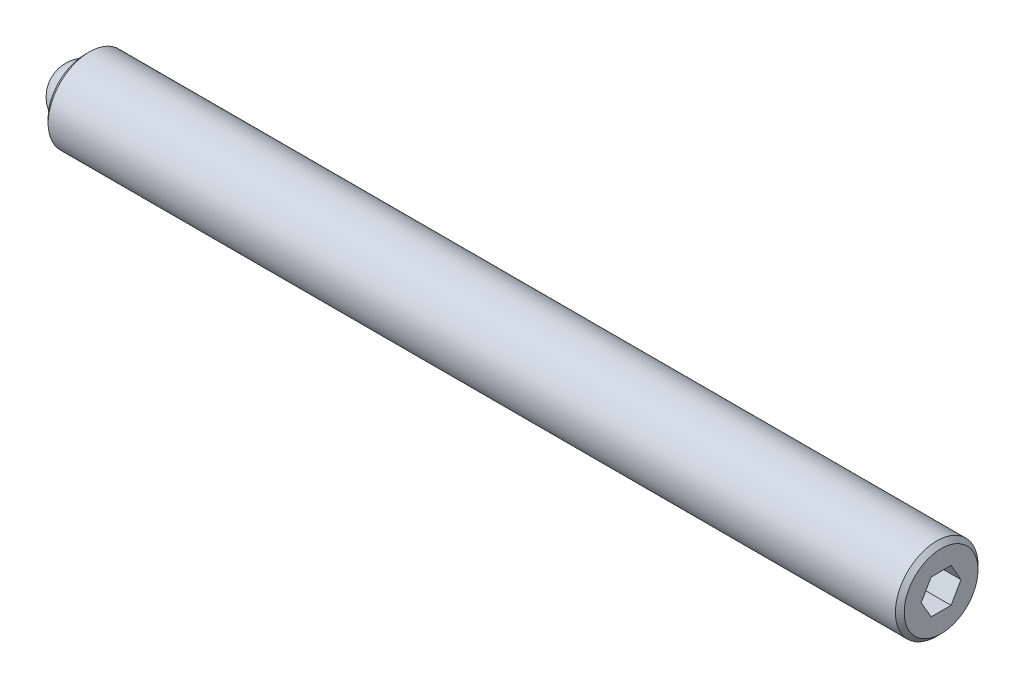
from build123d import *

# Parameters (mm, degrees)
SKETCH2_R           = 2.3749
BOSS_EXTRUDE1_DEPTH = 49.2125
CHAMFER1_SIZE       = 0.254
CHAMFER2_SIZE       = 0.254
CUT_EXTRUDE2_DEPTH  = 2.286
SKETCH3_R           = 1.5875
CUT_EXTRUDE3_DEPTH  = 1.5875
CUT_EXTRUDE6_DEPTH  = 1.5875


with BuildPart() as part:
    # Sketch2 → Boss-Extrude1 (new body)
    with BuildSketch(Plane(origin=(0, 0, 0), x_dir=(0, 0, -1), z_dir=(1, 0, 0))):
        Circle(SKETCH2_R)
    extrude(amount=BOSS_EXTRUDE1_DEPTH)

    # Chamfer1
    chamfer1_edges = [part.edges().sort_by_distance(p)[0] for p in [
        (0, 0, 2.3749),
    ]]
    chamfer(chamfer1_edges, length=CHAMFER1_SIZE)

    # Chamfer2
    chamfer2_edges = [part.edges().sort_by_distance(p)[0] for p in [
        (49.2125, 0, 2.3749),
    ]]
    chamfer(chamfer2_edges, length=CHAMFER2_SIZE)

    # Sketch4 → Cut-Extrude2 (cut)
    with BuildSketch(Plane(origin=(49.2125, 0, 0), x_dir=(0, 0, -1), z_dir=(1, 0, 0))):
        Polygon((1.14567944, 0), (0.57283972, 0.9921875), (-0.57283972, 0.9921875), (-1.14567944, 0), (-0.57283972, -0.9921875), (0.57283972, -0.9921875), align=None)
    extrude(amount=-CUT_EXTRUDE2_DEPTH, mode=Mode.SUBTRACT)

    # Sketch3 → Cut-Extrude3 (cut)
    with BuildSketch(Plane.ZY):
        Circle(SKETCH3_R)
    extrude(amount=-CUT_EXTRUDE3_DEPTH, mode=Mode.SUBTRACT)

    # Sketch6 → Cut-Extrude6 (cut)
    with BuildSketch(Plane.ZY):
        with BuildLine():
            ThreePointArc((0.063487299, 1.58623), (0, 1.5875), (-0.063487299, 1.58623))
            ThreePointArc((-0.063487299, 1.58623), (0, 1.651), (0.063487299, 1.58623))
        make_face()
    extrude(amount=-CUT_EXTRUDE6_DEPTH, mode=Mode.SUBTRACT)


with BuildPart() as body_2:
    # Sketch5 → Revolve1 (revolve)
    with BuildSketch(Plane.ZY):
        with BuildLine():
            Line((0, 0), (0, -1.5875))
            ThreePointArc((0, -1.5875), (-1.5875, 0), (0, 1.5875))
            Line((0, 1.5875), (0, 0))
        make_face()
    revolve(axis=Axis((0, 0, 0), (0, 1, 0)))


solid = Compound([part.part, body_2.part])
